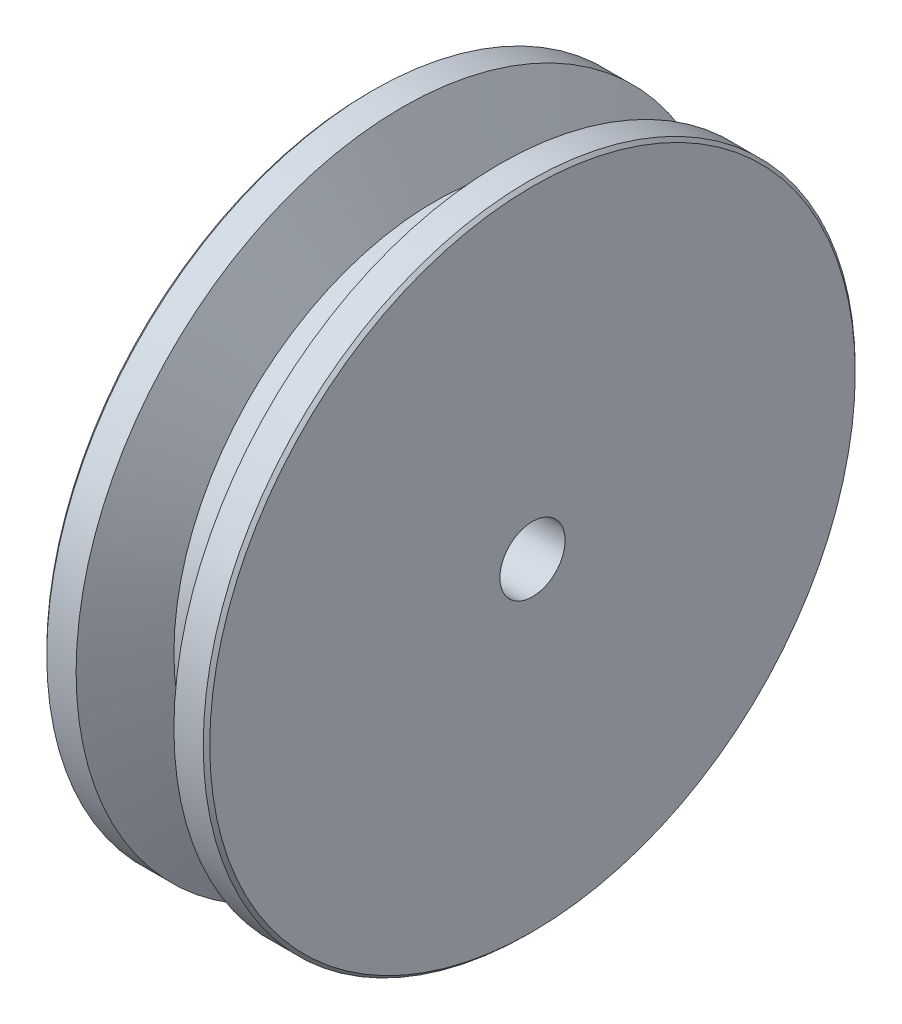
from build123d import *

# Parameters (mm, degrees)
CHAMFER_1_SIZE = 1
CHAMFER_2_SIZE = 5


with BuildPart() as part:
    # Sketch 1 → Revolve 1 (revolve)
    with BuildSketch(Plane.XY, mode=Mode.PRIVATE) as revolve_1_sk:
        Polygon((0, 100), (0, 40), (-30, 40), (-30, 10), (50, 10), (50, 100), (40, 100), (30, 80), (20, 80), (10, 100), align=None)
    revolve(revolve_1_sk.sketch.rotate(Axis((-74.074281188, 0, 0), (1, 0, 0)), 90), axis=Axis((-74.074281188, 0, 0), (1, 0, 0)))

    # Chamfer 1
    chamfer_1_edges = [part.edges().sort_by_distance(p)[0] for p in [
        (0, 0, -100),
        (50, 0, -100),
    ]]
    chamfer(chamfer_1_edges, length=CHAMFER_1_SIZE)

    # Chamfer 2
    chamfer_2_edges = [part.edges().sort_by_distance(p)[0] for p in [
        (-30, 0, -40),
    ]]
    chamfer(chamfer_2_edges, length=CHAMFER_2_SIZE)


solid = part.part
